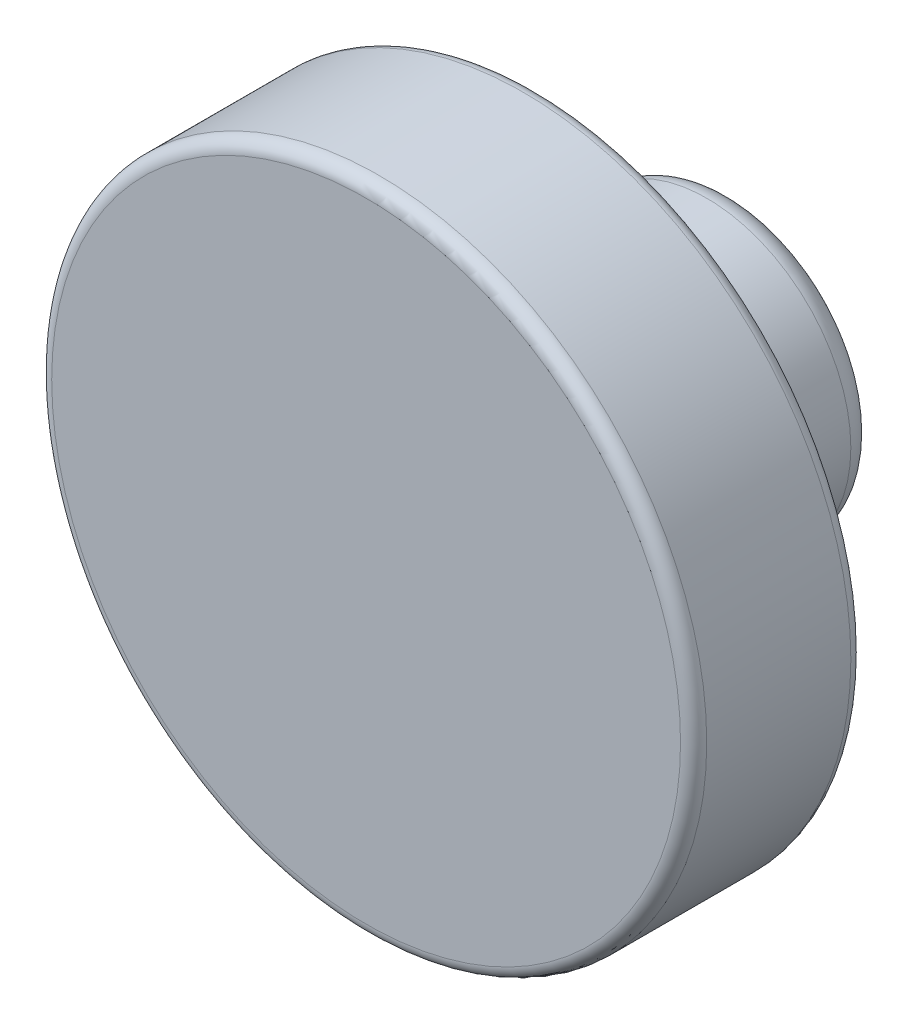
ISO-10303-21;
HEADER;
FILE_DESCRIPTION(('STEP AP214'),'2;1');
FILE_NAME('part.step','',(''),(''),'','','');
FILE_SCHEMA(('AUTOMOTIVE_DESIGN { 1 0 10303 214 1 1 1 1 }'));
ENDSEC;
DATA;
#1=APPLICATION_CONTEXT('core data for automotive mechanical design processes');
#2=APPLICATION_PROTOCOL_DEFINITION('international standard','automotive_design',2000,#1);
#3=PRODUCT_CONTEXT('',#1,'mechanical');
#4=PRODUCT('Part','Part','',(#3));
#5=PRODUCT_RELATED_PRODUCT_CATEGORY('part','',(#4));
#6=PRODUCT_DEFINITION_FORMATION('','',#4);
#7=PRODUCT_DEFINITION_CONTEXT('part definition',#1,'design');
#8=PRODUCT_DEFINITION('design','',#6,#7);
#9=PRODUCT_DEFINITION_SHAPE('','',#8);
#10=(LENGTH_UNIT() NAMED_UNIT(*) SI_UNIT(.MILLI.,.METRE.));
#11=(NAMED_UNIT(*) PLANE_ANGLE_UNIT() SI_UNIT($,.RADIAN.));
#12=(NAMED_UNIT(*) SI_UNIT($,.STERADIAN.) SOLID_ANGLE_UNIT());
#13=UNCERTAINTY_MEASURE_WITH_UNIT(LENGTH_MEASURE(1.E-05),#10,'distance_accuracy_value','');
#14=(GEOMETRIC_REPRESENTATION_CONTEXT(3) GLOBAL_UNCERTAINTY_ASSIGNED_CONTEXT((#13)) GLOBAL_UNIT_ASSIGNED_CONTEXT((#10,
#11,#12)) REPRESENTATION_CONTEXT('',''));
#15=CARTESIAN_POINT('',(0.,0.,0.));
#16=DIRECTION('',(0.,0.,1.));
#17=DIRECTION('',(1.,0.,0.));
#18=AXIS2_PLACEMENT_3D('',#15,#16,#17);
#19=CARTESIAN_POINT('',(0.,2.5,15.));
#20=DIRECTION('',(0.,0.,1.));
#21=DIRECTION('',(1.,0.,0.));
#22=AXIS2_PLACEMENT_3D('',#19,#20,#21);
#23=PLANE('',#22);
#24=CARTESIAN_POINT('',(0.,0.,15.));
#25=DIRECTION('',(0.,0.,1.));
#26=DIRECTION('',(1.,0.,0.));
#27=AXIS2_PLACEMENT_3D('',#24,#25,#26);
#28=CIRCLE('',#27,2.5);
#29=CARTESIAN_POINT('',(2.5,0.,15.));
#30=VERTEX_POINT('',#29);
#31=EDGE_CURVE('E8',#30,#30,#28,.T.);
#32=ORIENTED_EDGE('',*,*,#31,.F.);
#33=EDGE_LOOP('',(#32));
#34=FACE_BOUND('',#33,.T.);
#35=ADVANCED_FACE('F12',(#34),#23,.F.);
#36=CARTESIAN_POINT('',(0.,0.,33.));
#37=DIRECTION('',(0.,0.,1.));
#38=DIRECTION('',(1.,0.,0.));
#39=AXIS2_PLACEMENT_3D('',#36,#37,#38);
#40=CYLINDRICAL_SURFACE('',#39,2.5);
#41=CARTESIAN_POINT('',(0.,0.,0.));
#42=DIRECTION('',(0.,0.,1.));
#43=DIRECTION('',(1.,0.,0.));
#44=AXIS2_PLACEMENT_3D('',#41,#42,#43);
#45=CIRCLE('',#44,2.5);
#46=CARTESIAN_POINT('',(2.5,0.,0.));
#47=VERTEX_POINT('',#46);
#48=EDGE_CURVE('E18',#47,#47,#45,.T.);
#49=ORIENTED_EDGE('',*,*,#48,.F.);
#50=EDGE_LOOP('',(#49));
#51=FACE_BOUND('',#50,.T.);
#52=ORIENTED_EDGE('',*,*,#31,.T.);
#53=EDGE_LOOP('',(#52));
#54=FACE_BOUND('',#53,.T.);
#55=ADVANCED_FACE('F96',(#51,#54),#40,.F.);
#56=CARTESIAN_POINT('',(0.,9.,0.));
#57=DIRECTION('',(0.,0.,1.));
#58=DIRECTION('',(1.,0.,0.));
#59=AXIS2_PLACEMENT_3D('',#56,#57,#58);
#60=PLANE('',#59);
#61=CARTESIAN_POINT('',(0.,0.,0.));
#62=DIRECTION('',(0.,0.,1.));
#63=DIRECTION('',(1.,0.,0.));
#64=AXIS2_PLACEMENT_3D('',#61,#62,#63);
#65=CIRCLE('',#64,9.);
#66=CARTESIAN_POINT('',(9.,0.,0.));
#67=VERTEX_POINT('',#66);
#68=EDGE_CURVE('E22',#67,#67,#65,.T.);
#69=ORIENTED_EDGE('',*,*,#68,.F.);
#70=EDGE_LOOP('',(#69));
#71=FACE_BOUND('',#70,.T.);
#72=ORIENTED_EDGE('',*,*,#48,.T.);
#73=EDGE_LOOP('',(#72));
#74=FACE_BOUND('',#73,.T.);
#75=ADVANCED_FACE('F91',(#71,#74),#60,.F.);
#76=CARTESIAN_POINT('',(0.,0.,2.));
#77=DIRECTION('',(0.,0.,1.));
#78=DIRECTION('',(1.,0.,0.));
#79=AXIS2_PLACEMENT_3D('',#76,#77,#78);
#80=TOROIDAL_SURFACE('',#79,9.,2.);
#81=CARTESIAN_POINT('',(0.,0.,2.));
#82=DIRECTION('',(0.,0.,1.));
#83=DIRECTION('',(1.,0.,0.));
#84=AXIS2_PLACEMENT_3D('',#81,#82,#83);
#85=CIRCLE('',#84,11.);
#86=CARTESIAN_POINT('',(11.,0.,2.));
#87=VERTEX_POINT('',#86);
#88=EDGE_CURVE('E26',#87,#87,#85,.T.);
#89=ORIENTED_EDGE('',*,*,#88,.F.);
#90=EDGE_LOOP('',(#89));
#91=FACE_BOUND('',#90,.T.);
#92=ORIENTED_EDGE('',*,*,#68,.T.);
#93=EDGE_LOOP('',(#92));
#94=FACE_BOUND('',#93,.T.);
#95=ADVANCED_FACE('F85',(#91,#94),#80,.T.);
#96=CARTESIAN_POINT('',(0.,0.,33.));
#97=DIRECTION('',(0.,0.,1.));
#98=DIRECTION('',(1.,0.,0.));
#99=AXIS2_PLACEMENT_3D('',#96,#97,#98);
#100=CYLINDRICAL_SURFACE('',#99,11.);
#101=CARTESIAN_POINT('',(0.,0.,12.));
#102=DIRECTION('',(0.,0.,1.));
#103=DIRECTION('',(1.,0.,0.));
#104=AXIS2_PLACEMENT_3D('',#101,#102,#103);
#105=CIRCLE('',#104,11.);
#106=CARTESIAN_POINT('',(11.,0.,12.));
#107=VERTEX_POINT('',#106);
#108=EDGE_CURVE('E31',#107,#107,#105,.T.);
#109=ORIENTED_EDGE('',*,*,#108,.F.);
#110=EDGE_LOOP('',(#109));
#111=FACE_BOUND('',#110,.T.);
#112=ORIENTED_EDGE('',*,*,#88,.T.);
#113=EDGE_LOOP('',(#112));
#114=FACE_BOUND('',#113,.T.);
#115=ADVANCED_FACE('F79',(#111,#114),#100,.T.);
#116=CARTESIAN_POINT('',(0.,0.,12.));
#117=DIRECTION('',(0.,0.,1.));
#118=DIRECTION('',(1.,0.,0.));
#119=AXIS2_PLACEMENT_3D('',#116,#117,#118);
#120=TOROIDAL_SURFACE('',#119,14.,3.);
#121=CARTESIAN_POINT('',(0.,0.,15.));
#122=DIRECTION('',(0.,0.,1.));
#123=DIRECTION('',(1.,0.,0.));
#124=AXIS2_PLACEMENT_3D('',#121,#122,#123);
#125=CIRCLE('',#124,14.);
#126=CARTESIAN_POINT('',(14.,0.,15.));
#127=VERTEX_POINT('',#126);
#128=EDGE_CURVE('E34',#127,#127,#125,.T.);
#129=ORIENTED_EDGE('',*,*,#128,.F.);
#130=EDGE_LOOP('',(#129));
#131=FACE_BOUND('',#130,.T.);
#132=ORIENTED_EDGE('',*,*,#108,.T.);
#133=EDGE_LOOP('',(#132));
#134=FACE_BOUND('',#133,.T.);
#135=ADVANCED_FACE('F73',(#131,#134),#120,.F.);
#136=CARTESIAN_POINT('',(0.,24.,15.));
#137=DIRECTION('',(0.,0.,1.));
#138=DIRECTION('',(1.,0.,0.));
#139=AXIS2_PLACEMENT_3D('',#136,#137,#138);
#140=PLANE('',#139);
#141=CARTESIAN_POINT('',(0.,0.,15.));
#142=DIRECTION('',(0.,0.,1.));
#143=DIRECTION('',(1.,0.,0.));
#144=AXIS2_PLACEMENT_3D('',#141,#142,#143);
#145=CIRCLE('',#144,24.);
#146=CARTESIAN_POINT('',(24.,0.,15.));
#147=VERTEX_POINT('',#146);
#148=EDGE_CURVE('E37',#147,#147,#145,.T.);
#149=ORIENTED_EDGE('',*,*,#148,.F.);
#150=EDGE_LOOP('',(#149));
#151=FACE_BOUND('',#150,.T.);
#152=ORIENTED_EDGE('',*,*,#128,.T.);
#153=EDGE_LOOP('',(#152));
#154=FACE_BOUND('',#153,.T.);
#155=ADVANCED_FACE('F67',(#151,#154),#140,.F.);
#156=CARTESIAN_POINT('',(0.,0.,16.));
#157=DIRECTION('',(0.,0.,1.));
#158=DIRECTION('',(1.,0.,0.));
#159=AXIS2_PLACEMENT_3D('',#156,#157,#158);
#160=TOROIDAL_SURFACE('',#159,24.,1.00000000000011);
#161=CARTESIAN_POINT('',(0.,0.,16.));
#162=DIRECTION('',(0.,0.,1.));
#163=DIRECTION('',(1.,0.,0.));
#164=AXIS2_PLACEMENT_3D('',#161,#162,#163);
#165=CIRCLE('',#164,25.);
#166=CARTESIAN_POINT('',(25.,0.,16.));
#167=VERTEX_POINT('',#166);
#168=EDGE_CURVE('E40',#167,#167,#165,.T.);
#169=ORIENTED_EDGE('',*,*,#168,.F.);
#170=EDGE_LOOP('',(#169));
#171=FACE_BOUND('',#170,.T.);
#172=ORIENTED_EDGE('',*,*,#148,.T.);
#173=EDGE_LOOP('',(#172));
#174=FACE_BOUND('',#173,.T.);
#175=ADVANCED_FACE('F61',(#171,#174),#160,.T.);
#176=CARTESIAN_POINT('',(0.,0.,33.));
#177=DIRECTION('',(0.,0.,1.));
#178=DIRECTION('',(1.,0.,0.));
#179=AXIS2_PLACEMENT_3D('',#176,#177,#178);
#180=CYLINDRICAL_SURFACE('',#179,25.);
#181=CARTESIAN_POINT('',(0.,0.,27.));
#182=DIRECTION('',(0.,0.,1.));
#183=DIRECTION('',(1.,0.,0.));
#184=AXIS2_PLACEMENT_3D('',#181,#182,#183);
#185=CIRCLE('',#184,25.);
#186=CARTESIAN_POINT('',(25.,0.,27.));
#187=VERTEX_POINT('',#186);
#188=EDGE_CURVE('E43',#187,#187,#185,.T.);
#189=ORIENTED_EDGE('',*,*,#188,.F.);
#190=EDGE_LOOP('',(#189));
#191=FACE_BOUND('',#190,.T.);
#192=ORIENTED_EDGE('',*,*,#168,.T.);
#193=EDGE_LOOP('',(#192));
#194=FACE_BOUND('',#193,.T.);
#195=ADVANCED_FACE('F55',(#191,#194),#180,.T.);
#196=CARTESIAN_POINT('',(0.,0.,27.));
#197=DIRECTION('',(0.,0.,1.));
#198=DIRECTION('',(1.,0.,0.));
#199=AXIS2_PLACEMENT_3D('',#196,#197,#198);
#200=TOROIDAL_SURFACE('',#199,24.,0.999999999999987);
#201=CARTESIAN_POINT('',(0.,0.,28.));
#202=DIRECTION('',(0.,0.,1.));
#203=DIRECTION('',(1.,0.,0.));
#204=AXIS2_PLACEMENT_3D('',#201,#202,#203);
#205=CIRCLE('',#204,24.);
#206=CARTESIAN_POINT('',(24.,0.,28.));
#207=VERTEX_POINT('',#206);
#208=EDGE_CURVE('E46',#207,#207,#205,.T.);
#209=ORIENTED_EDGE('',*,*,#208,.F.);
#210=EDGE_LOOP('',(#209));
#211=FACE_BOUND('',#210,.T.);
#212=ORIENTED_EDGE('',*,*,#188,.T.);
#213=EDGE_LOOP('',(#212));
#214=FACE_BOUND('',#213,.T.);
#215=ADVANCED_FACE('F52',(#211,#214),#200,.T.);
#216=CARTESIAN_POINT('',(0.,24.,28.));
#217=DIRECTION('',(0.,0.,-1.));
#218=DIRECTION('',(-1.,0.,0.));
#219=AXIS2_PLACEMENT_3D('',#216,#217,#218);
#220=PLANE('',#219);
#221=ORIENTED_EDGE('',*,*,#208,.T.);
#222=EDGE_LOOP('',(#221));
#223=FACE_BOUND('',#222,.T.);
#224=ADVANCED_FACE('F50',(#223),#220,.F.);
#225=CLOSED_SHELL('',(#35,#55,#75,#95,#115,#135,#155,#175,#195,#215,#224));
#226=MANIFOLD_SOLID_BREP('B1',#225);
#227=ADVANCED_BREP_SHAPE_REPRESENTATION('',(#18,#226),#14);
#228=SHAPE_DEFINITION_REPRESENTATION(#9,#227);
ENDSEC;
END-ISO-10303-21;
